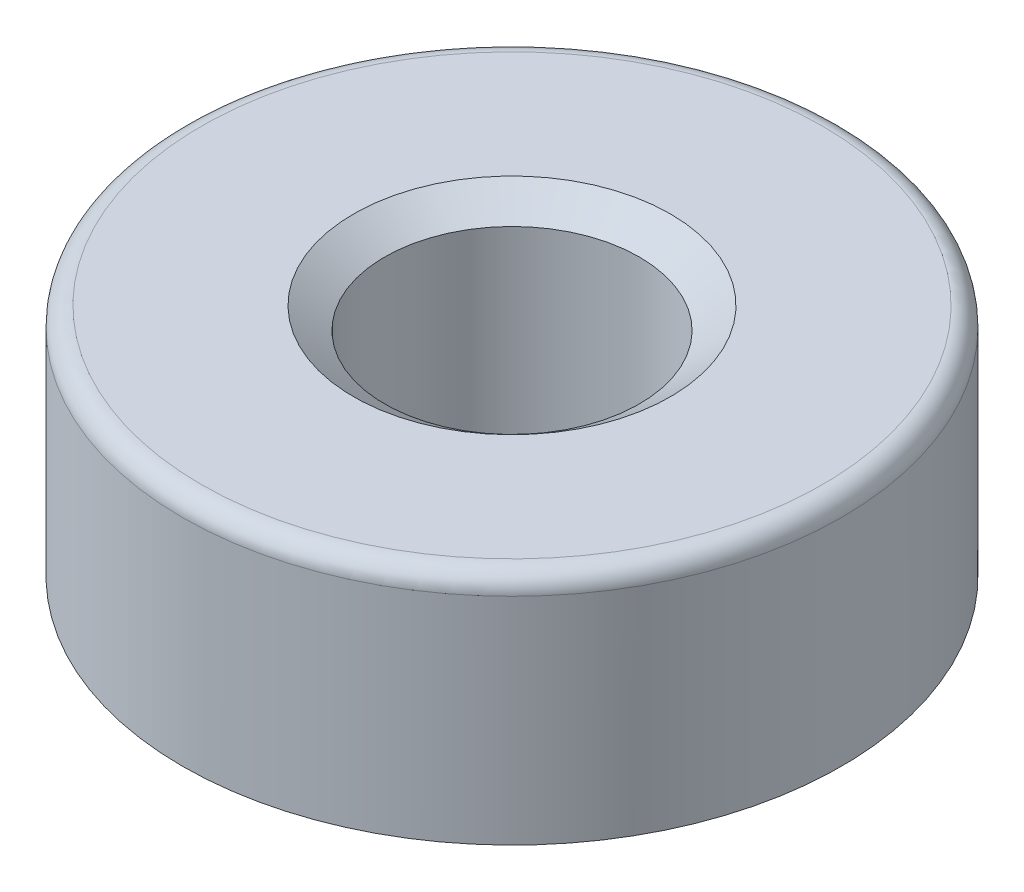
ISO-10303-21;
HEADER;
FILE_DESCRIPTION(('STEP AP214'),'2;1');
FILE_NAME('part.step','',(''),(''),'','','');
FILE_SCHEMA(('AUTOMOTIVE_DESIGN { 1 0 10303 214 1 1 1 1 }'));
ENDSEC;
DATA;
#1=APPLICATION_CONTEXT('core data for automotive mechanical design processes');
#2=APPLICATION_PROTOCOL_DEFINITION('international standard','automotive_design',2000,#1);
#3=PRODUCT_CONTEXT('',#1,'mechanical');
#4=PRODUCT('Part','Part','',(#3));
#5=PRODUCT_RELATED_PRODUCT_CATEGORY('part','',(#4));
#6=PRODUCT_DEFINITION_FORMATION('','',#4);
#7=PRODUCT_DEFINITION_CONTEXT('part definition',#1,'design');
#8=PRODUCT_DEFINITION('design','',#6,#7);
#9=PRODUCT_DEFINITION_SHAPE('','',#8);
#10=(LENGTH_UNIT() NAMED_UNIT(*) SI_UNIT(.MILLI.,.METRE.));
#11=(NAMED_UNIT(*) PLANE_ANGLE_UNIT() SI_UNIT($,.RADIAN.));
#12=(NAMED_UNIT(*) SI_UNIT($,.STERADIAN.) SOLID_ANGLE_UNIT());
#13=UNCERTAINTY_MEASURE_WITH_UNIT(LENGTH_MEASURE(1.E-05),#10,'distance_accuracy_value','');
#14=(GEOMETRIC_REPRESENTATION_CONTEXT(3) GLOBAL_UNCERTAINTY_ASSIGNED_CONTEXT((#13)) GLOBAL_UNIT_ASSIGNED_CONTEXT((#10,
#11,#12)) REPRESENTATION_CONTEXT('',''));
#15=CARTESIAN_POINT('',(0.,0.,0.));
#16=DIRECTION('',(0.,0.,1.));
#17=DIRECTION('',(1.,0.,0.));
#18=AXIS2_PLACEMENT_3D('',#15,#16,#17);
#19=CARTESIAN_POINT('',(0.,-0.6096,0.));
#20=DIRECTION('',(0.,1.,0.));
#21=DIRECTION('',(0.,0.,1.));
#22=AXIS2_PLACEMENT_3D('',#19,#20,#21);
#23=CONICAL_SURFACE('',#22,5.7370345,0.957964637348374);
#24=CARTESIAN_POINT('',(-4.13117819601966,-0.609799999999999,3.9804105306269));
#25=CARTESIAN_POINT('',(-4.20611833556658,-0.50848893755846,4.11021065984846));
#26=CARTESIAN_POINT('',(-4.28099927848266,-0.407003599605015,4.23990825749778));
#27=CARTESIAN_POINT('',(-4.43064275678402,-0.203684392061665,4.49909836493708));
#28=CARTESIAN_POINT('',(-4.50540529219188,-0.10185052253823,4.62859087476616));
#29=CARTESIAN_POINT('',(-4.58010863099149,0.000157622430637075,4.75798085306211));
#30=B_SPLINE_CURVE_WITH_KNOTS('',3,(#24,#25,#26,#27,#28,#29),.UNSPECIFIED.,.F.,.F.,(4,2,4),(0.,
0.542725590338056,1.08545107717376),.UNSPECIFIED.);
#31=CARTESIAN_POINT('',(-4.13132619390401,-0.609599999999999,3.98066687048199));
#32=VERTEX_POINT('',#31);
#33=CARTESIAN_POINT('',(-4.57999316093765,0.,4.75778085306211));
#34=VERTEX_POINT('',#33);
#35=EDGE_CURVE('E285',#32,#34,#30,.T.);
#36=ORIENTED_EDGE('',*,*,#35,.F.);
#37=CARTESIAN_POINT('',(0.,-0.6096,0.));
#38=DIRECTION('',(0.,-1.,0.));
#39=DIRECTION('',(0.,0.,-1.));
#40=AXIS2_PLACEMENT_3D('',#37,#38,#39);
#41=CIRCLE('',#40,5.7370345);
#42=CARTESIAN_POINT('',(-1.38169553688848,-0.6096,5.56816687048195));
#43=VERTEX_POINT('',#42);
#44=EDGE_CURVE('E225',#43,#32,#41,.T.);
#45=ORIENTED_EDGE('',*,*,#44,.F.);
#46=CARTESIAN_POINT('',(-1.83047797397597,0.000157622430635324,6.34548085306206));
#47=CARTESIAN_POINT('',(-1.75577463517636,-0.101850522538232,6.21609087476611));
#48=CARTESIAN_POINT('',(-1.6810120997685,-0.203684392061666,6.08659836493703));
#49=CARTESIAN_POINT('',(-1.53136862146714,-0.407003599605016,5.82740825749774));
#50=CARTESIAN_POINT('',(-1.45648767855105,-0.50848893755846,5.69771065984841));
#51=CARTESIAN_POINT('',(-1.38154753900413,-0.6098,5.56791053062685));
#52=B_SPLINE_CURVE_WITH_KNOTS('',3,(#46,#47,#48,#49,#50,#51),.UNSPECIFIED.,.F.,.F.,(4,2,4),(0.,
0.542725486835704,1.08545107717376),.UNSPECIFIED.);
#53=CARTESIAN_POINT('',(-1.83036250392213,0.,6.34528085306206));
#54=VERTEX_POINT('',#53);
#55=EDGE_CURVE('E193',#54,#43,#52,.T.);
#56=ORIENTED_EDGE('',*,*,#55,.F.);
#57=CARTESIAN_POINT('',(0.,0.,0.));
#58=DIRECTION('',(0.,-1.,0.));
#59=DIRECTION('',(0.,0.,-1.));
#60=AXIS2_PLACEMENT_3D('',#57,#58,#59);
#61=CIRCLE('',#60,6.604);
#62=EDGE_CURVE('E148',#54,#34,#61,.T.);
#63=ORIENTED_EDGE('',*,*,#62,.T.);
#64=EDGE_LOOP('',(#36,#45,#56,#63));
#65=FACE_BOUND('',#64,.T.);
#66=ADVANCED_FACE('F41',(#65),#23,.T.);
#67=CARTESIAN_POINT('',(0.,0.,0.));
#68=DIRECTION('',(0.,-1.,0.));
#69=DIRECTION('',(0.,0.,-1.));
#70=AXIS2_PLACEMENT_3D('',#67,#68,#69);
#71=CONICAL_SURFACE('',#70,4.8674655,0.959374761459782);
#72=CARTESIAN_POINT('',(-3.67535542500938,0.000153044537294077,3.19090233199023));
#73=CARTESIAN_POINT('',(-3.71346949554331,-0.0503643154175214,3.25691783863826));
#74=CARTESIAN_POINT('',(-3.75155322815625,-0.100973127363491,3.32288079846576));
#75=CARTESIAN_POINT('',(-3.8276665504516,-0.202352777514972,3.45471293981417));
#76=CARTESIAN_POINT('',(-3.8656961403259,-0.253123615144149,3.52058212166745));
#77=CARTESIAN_POINT('',(-3.94170795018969,-0.354806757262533,3.65223843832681));
#78=CARTESIAN_POINT('',(-3.97969017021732,-0.405719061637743,3.71802557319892));
#79=CARTESIAN_POINT('',(-4.05561262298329,-0.507669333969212,3.84952711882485));
#80=CARTESIAN_POINT('',(-4.09355285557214,-0.55870730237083,3.91524152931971));
#81=CARTESIAN_POINT('',(-4.13147463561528,-0.609800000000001,3.98092397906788));
#82=B_SPLINE_CURVE_WITH_KNOTS('',3,(#72,#73,#74,#75,#76,#77,#78,#79,#80,#81),.UNSPECIFIED.,.F.,
.F.,(4,2,2,2,4),(0.,0.274343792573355,0.548686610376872,0.823029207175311,1.09737277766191),.UNSPECIFIED.);
#83=CARTESIAN_POINT('',(-3.67547089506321,0.,3.19110233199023));
#84=VERTEX_POINT('',#83);
#85=EDGE_CURVE('E145',#84,#32,#82,.T.);
#86=ORIENTED_EDGE('',*,*,#85,.F.);
#87=CARTESIAN_POINT('',(0.,0.,0.));
#88=DIRECTION('',(0.,-1.,0.));
#89=DIRECTION('',(0.,0.,-1.));
#90=AXIS2_PLACEMENT_3D('',#87,#88,#89);
#91=CIRCLE('',#90,4.8674655);
#92=CARTESIAN_POINT('',(-0.925840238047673,0.,4.77860233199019));
#93=VERTEX_POINT('',#92);
#94=EDGE_CURVE('E227',#93,#84,#91,.T.);
#95=ORIENTED_EDGE('',*,*,#94,.F.);
#96=CARTESIAN_POINT('',(-1.38184397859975,-0.6098,5.56842397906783));
#97=CARTESIAN_POINT('',(-1.34392219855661,-0.558707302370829,5.50274152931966));
#98=CARTESIAN_POINT('',(-1.30598196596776,-0.507669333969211,5.4370271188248));
#99=CARTESIAN_POINT('',(-1.23005951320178,-0.405719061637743,5.30552557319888));
#100=CARTESIAN_POINT('',(-1.19207729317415,-0.354806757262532,5.23973843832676));
#101=CARTESIAN_POINT('',(-1.11606548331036,-0.253123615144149,5.10808212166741));
#102=CARTESIAN_POINT('',(-1.07803589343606,-0.202352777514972,5.04221293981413));
#103=CARTESIAN_POINT('',(-1.00192257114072,-0.100973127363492,4.91038079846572));
#104=CARTESIAN_POINT('',(-0.963838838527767,-0.0503643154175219,4.84441783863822));
#105=CARTESIAN_POINT('',(-0.925724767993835,0.000153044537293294,4.77840233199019));
#106=B_SPLINE_CURVE_WITH_KNOTS('',3,(#96,#97,#98,#99,#100,#101,#102,#103,#104,#105),
.UNSPECIFIED.,.F.,.F.,(4,2,2,2,4),(0.,0.274343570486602,0.54868616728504,0.823028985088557,
1.09737277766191),.UNSPECIFIED.);
#107=EDGE_CURVE('E157',#43,#93,#106,.T.);
#108=ORIENTED_EDGE('',*,*,#107,.F.);
#109=ORIENTED_EDGE('',*,*,#44,.T.);
#110=EDGE_LOOP('',(#86,#95,#108,#109));
#111=FACE_BOUND('',#110,.T.);
#112=ADVANCED_FACE('F256',(#111),#71,.F.);
#113=CARTESIAN_POINT('',(-4.58010863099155,0.000157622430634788,-4.75798085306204));
#114=CARTESIAN_POINT('',(-4.50540529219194,-0.101850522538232,-4.6285908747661));
#115=CARTESIAN_POINT('',(-4.43064275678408,-0.203684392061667,-4.49909836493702));
#116=CARTESIAN_POINT('',(-4.28099927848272,-0.407003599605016,-4.23990825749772));
#117=CARTESIAN_POINT('',(-4.20611833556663,-0.50848893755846,-4.1102106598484));
#118=CARTESIAN_POINT('',(-4.13117819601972,-0.609799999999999,-3.98041053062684));
#119=B_SPLINE_CURVE_WITH_KNOTS('',3,(#113,#114,#115,#116,#117,#118),.UNSPECIFIED.,.F.,.F.,(4,2,
4),(0.,0.542725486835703,1.08545107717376),.UNSPECIFIED.);
#120=CARTESIAN_POINT('',(-4.57999316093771,0.,-4.75778085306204));
#121=VERTEX_POINT('',#120);
#122=CARTESIAN_POINT('',(-4.13132619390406,-0.6096,-3.98066687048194));
#123=VERTEX_POINT('',#122);
#124=EDGE_CURVE('E130',#121,#123,#119,.T.);
#125=ORIENTED_EDGE('',*,*,#124,.F.);
#126=CARTESIAN_POINT('',(-1.83036250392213,0.,-6.34528085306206));
#127=VERTEX_POINT('',#126);
#128=EDGE_CURVE('E136',#121,#127,#61,.T.);
#129=ORIENTED_EDGE('',*,*,#128,.T.);
#130=CARTESIAN_POINT('',(-1.38154753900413,-0.6098,-5.56791053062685));
#131=CARTESIAN_POINT('',(-1.45648767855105,-0.50848893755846,-5.69771065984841));
#132=CARTESIAN_POINT('',(-1.53136862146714,-0.407003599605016,-5.82740825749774));
#133=CARTESIAN_POINT('',(-1.6810120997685,-0.203684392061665,-6.08659836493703));
#134=CARTESIAN_POINT('',(-1.75577463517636,-0.101850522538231,-6.21609087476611));
#135=CARTESIAN_POINT('',(-1.83047797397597,0.000157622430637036,-6.34548085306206));
#136=B_SPLINE_CURVE_WITH_KNOTS('',3,(#130,#131,#132,#133,#134,#135),.UNSPECIFIED.,.F.,.F.,(4,2,
4),(0.,0.542725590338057,1.08545107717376),.UNSPECIFIED.);
#137=CARTESIAN_POINT('',(-1.38169553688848,-0.6096,-5.56816687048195));
#138=VERTEX_POINT('',#137);
#139=EDGE_CURVE('E277',#138,#127,#136,.T.);
#140=ORIENTED_EDGE('',*,*,#139,.F.);
#141=EDGE_CURVE('E142',#123,#138,#41,.T.);
#142=ORIENTED_EDGE('',*,*,#141,.F.);
#143=EDGE_LOOP('',(#125,#129,#140,#142));
#144=FACE_BOUND('',#143,.T.);
#145=ADVANCED_FACE('F140',(#144),#23,.T.);
#146=CARTESIAN_POINT('',(-4.13147463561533,-0.6098,-3.98092397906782));
#147=CARTESIAN_POINT('',(-4.09355285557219,-0.558707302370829,-3.91524152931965));
#148=CARTESIAN_POINT('',(-4.05561262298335,-0.507669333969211,-3.84952711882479));
#149=CARTESIAN_POINT('',(-3.97969017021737,-0.405719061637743,-3.71802557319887));
#150=CARTESIAN_POINT('',(-3.94170795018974,-0.354806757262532,-3.65223843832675));
#151=CARTESIAN_POINT('',(-3.86569614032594,-0.253123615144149,-3.5205821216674));
#152=CARTESIAN_POINT('',(-3.82766655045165,-0.202352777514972,-3.45471293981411));
#153=CARTESIAN_POINT('',(-3.7515532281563,-0.100973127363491,-3.3228807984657));
#154=CARTESIAN_POINT('',(-3.71346949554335,-0.0503643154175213,-3.25691783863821));
#155=CARTESIAN_POINT('',(-3.67535542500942,0.000153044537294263,-3.19090233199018));
#156=B_SPLINE_CURVE_WITH_KNOTS('',3,(#146,#147,#148,#149,#150,#151,#152,#153,#154,#155),
.UNSPECIFIED.,.F.,.F.,(4,2,2,2,4),(0.,0.274343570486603,0.548686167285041,0.823028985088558,
1.09737277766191),.UNSPECIFIED.);
#157=CARTESIAN_POINT('',(-3.67547089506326,0.,-3.19110233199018));
#158=VERTEX_POINT('',#157);
#159=EDGE_CURVE('E135',#123,#158,#156,.T.);
#160=ORIENTED_EDGE('',*,*,#159,.F.);
#161=ORIENTED_EDGE('',*,*,#141,.T.);
#162=CARTESIAN_POINT('',(-0.925724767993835,0.000153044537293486,-4.77840233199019));
#163=CARTESIAN_POINT('',(-0.963838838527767,-0.0503643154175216,-4.84441783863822));
#164=CARTESIAN_POINT('',(-1.00192257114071,-0.100973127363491,-4.91038079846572));
#165=CARTESIAN_POINT('',(-1.07803589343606,-0.202352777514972,-5.04221293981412));
#166=CARTESIAN_POINT('',(-1.11606548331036,-0.253123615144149,-5.10808212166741));
#167=CARTESIAN_POINT('',(-1.19207729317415,-0.354806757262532,-5.23973843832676));
#168=CARTESIAN_POINT('',(-1.23005951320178,-0.405719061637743,-5.30552557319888));
#169=CARTESIAN_POINT('',(-1.30598196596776,-0.507669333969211,-5.4370271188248));
#170=CARTESIAN_POINT('',(-1.34392219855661,-0.558707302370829,-5.50274152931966));
#171=CARTESIAN_POINT('',(-1.38184397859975,-0.6098,-5.56842397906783));
#172=B_SPLINE_CURVE_WITH_KNOTS('',3,(#162,#163,#164,#165,#166,#167,#168,#169,#170,#171),
.UNSPECIFIED.,.F.,.F.,(4,2,2,2,4),(0.,0.274343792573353,0.54868661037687,0.823029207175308,
1.09737277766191),.UNSPECIFIED.);
#173=CARTESIAN_POINT('',(-0.925840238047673,0.,-4.77860233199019));
#174=VERTEX_POINT('',#173);
#175=EDGE_CURVE('E12',#174,#138,#172,.T.);
#176=ORIENTED_EDGE('',*,*,#175,.F.);
#177=EDGE_CURVE('E229',#158,#174,#91,.T.);
#178=ORIENTED_EDGE('',*,*,#177,.F.);
#179=EDGE_LOOP('',(#160,#161,#176,#178));
#180=FACE_BOUND('',#179,.T.);
#181=ADVANCED_FACE('F265',(#180),#71,.F.);
#182=CARTESIAN_POINT('',(8.88359413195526,1.70183097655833,-1.5875));
#183=CARTESIAN_POINT('',(8.62766235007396,1.52469212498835,-1.5875));
#184=CARTESIAN_POINT('',(8.37162948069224,1.34769885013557,-1.5875));
#185=CARTESIAN_POINT('',(7.85927634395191,0.994136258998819,-1.5875));
#186=CARTESIAN_POINT('',(7.60295608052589,0.817566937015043,-1.5875));
#187=CARTESIAN_POINT('',(7.08997105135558,0.465004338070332,-1.5875));
#188=CARTESIAN_POINT('',(6.83330633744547,0.289010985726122,-1.5875));
#189=CARTESIAN_POINT('',(6.31945101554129,-0.0622159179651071,-1.5875));
#190=CARTESIAN_POINT('',(6.0622603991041,-0.237449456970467,-1.5875));
#191=CARTESIAN_POINT('',(5.54708808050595,-0.586858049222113,-1.5875));
#192=CARTESIAN_POINT('',(5.2891062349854,-0.761032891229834,-1.5875));
#193=CARTESIAN_POINT('',(4.77205723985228,-1.10774785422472,-1.5875));
#194=CARTESIAN_POINT('',(4.51299013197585,-1.2802880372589,-1.5875));
#195=CARTESIAN_POINT('',(4.12306667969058,-1.53714244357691,-1.5875));
#196=CARTESIAN_POINT('',(3.9928600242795,-1.62244214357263,-1.5875));
#197=CARTESIAN_POINT('',(3.73188216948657,-1.79216931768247,-1.5875));
#198=CARTESIAN_POINT('',(3.60111097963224,-1.87659680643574,-1.5875));
#199=CARTESIAN_POINT('',(3.33881666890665,-2.04431754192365,-1.5875));
#200=CARTESIAN_POINT('',(3.20729345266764,-2.12761064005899,-1.5875));
#201=CARTESIAN_POINT('',(2.94322406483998,-2.29257431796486,-1.5875));
#202=CARTESIAN_POINT('',(2.81067783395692,-2.37424480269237,-1.5875));
#203=CARTESIAN_POINT('',(2.67748382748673,-2.45486052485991,-1.5875));
#204=B_SPLINE_CURVE_WITH_KNOTS('',3,(#182,#183,#184,#185,#186,#187,#188,#189,#190,#191,#192,
#193,#194,#195,#196,#197,#198,#199,#200,#201,#202,#203),.UNSPECIFIED.,.F.,.F.,(4,2,2,2,2,2,2,2,
2,2,4),(0.,0.933763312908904,1.86751400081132,2.80113715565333,3.73477541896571,
4.66859422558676,5.60237744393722,6.06935260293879,6.53631991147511,7.00334781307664,
7.47040299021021),.UNSPECIFIED.);
#205=CARTESIAN_POINT('',(6.41035566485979,0.,-1.5875));
#206=VERTEX_POINT('',#205);
#207=CARTESIAN_POINT('',(5.51302173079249,-0.6096,-1.5875));
#208=VERTEX_POINT('',#207);
#209=EDGE_CURVE('E271',#206,#208,#204,.T.);
#210=ORIENTED_EDGE('',*,*,#209,.F.);
#211=CARTESIAN_POINT('',(6.41035566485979,0.,1.5875));
#212=VERTEX_POINT('',#211);
#213=EDGE_CURVE('E150',#206,#212,#61,.T.);
#214=ORIENTED_EDGE('',*,*,#213,.T.);
#215=CARTESIAN_POINT('',(2.67748382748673,-2.45486052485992,1.5875));
#216=CARTESIAN_POINT('',(2.81067783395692,-2.37424480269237,1.5875));
#217=CARTESIAN_POINT('',(2.94322406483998,-2.29257431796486,1.5875));
#218=CARTESIAN_POINT('',(3.20729345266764,-2.12761064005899,1.5875));
#219=CARTESIAN_POINT('',(3.33881666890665,-2.04431754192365,1.5875));
#220=CARTESIAN_POINT('',(3.60111097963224,-1.87659680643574,1.5875));
#221=CARTESIAN_POINT('',(3.73188216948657,-1.79216931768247,1.5875));
#222=CARTESIAN_POINT('',(3.9928600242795,-1.62244214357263,1.5875));
#223=CARTESIAN_POINT('',(4.12306667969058,-1.53714244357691,1.5875));
#224=CARTESIAN_POINT('',(4.51299013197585,-1.2802880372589,1.5875));
#225=CARTESIAN_POINT('',(4.77205723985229,-1.10774785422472,1.5875));
#226=CARTESIAN_POINT('',(5.28910623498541,-0.761032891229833,1.5875));
#227=CARTESIAN_POINT('',(5.54708808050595,-0.586858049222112,1.5875));
#228=CARTESIAN_POINT('',(6.0622603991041,-0.237449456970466,1.5875));
#229=CARTESIAN_POINT('',(6.31945101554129,-0.0622159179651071,1.5875));
#230=CARTESIAN_POINT('',(6.83330633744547,0.289010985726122,1.5875));
#231=CARTESIAN_POINT('',(7.08997105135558,0.465004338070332,1.5875));
#232=CARTESIAN_POINT('',(7.60295608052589,0.817566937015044,1.5875));
#233=CARTESIAN_POINT('',(7.85927634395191,0.99413625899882,1.5875));
#234=CARTESIAN_POINT('',(8.37162948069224,1.34769885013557,1.5875));
#235=CARTESIAN_POINT('',(8.62766235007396,1.52469212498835,1.5875));
#236=CARTESIAN_POINT('',(8.88359413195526,1.70183097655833,1.5875));
#237=B_SPLINE_CURVE_WITH_KNOTS('',3,(#215,#216,#217,#218,#219,#220,#221,#222,#223,#224,#225,
#226,#227,#228,#229,#230,#231,#232,#233,#234,#235,#236),.UNSPECIFIED.,.F.,.F.,(4,2,2,2,2,2,2,2,
2,2,4),(0.,0.467055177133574,0.934083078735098,1.40105038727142,1.868025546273,2.80180876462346,
3.73562757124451,4.66926583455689,5.60288898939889,6.53663967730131,7.47040299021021),.UNSPECIFIED.);
#238=CARTESIAN_POINT('',(5.51302173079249,-0.6096,1.5875));
#239=VERTEX_POINT('',#238);
#240=EDGE_CURVE('E202',#239,#212,#237,.T.);
#241=ORIENTED_EDGE('',*,*,#240,.F.);
#242=EDGE_CURVE('E228',#208,#239,#41,.T.);
#243=ORIENTED_EDGE('',*,*,#242,.F.);
#244=EDGE_LOOP('',(#210,#214,#241,#243));
#245=FACE_BOUND('',#244,.T.);
#246=ADVANCED_FACE('F43',(#245),#23,.T.);
#247=CARTESIAN_POINT('',(0.,0.,0.));
#248=DIRECTION('',(0.,-1.,0.));
#249=DIRECTION('',(0.,0.,-1.));
#250=AXIS2_PLACEMENT_3D('',#247,#248,#249);
#251=CYLINDRICAL_SURFACE('',#250,6.604);
#252=CARTESIAN_POINT('',(0.,4.318,0.));
#253=DIRECTION('',(0.,-1.,0.));
#254=DIRECTION('',(0.,0.,-1.));
#255=AXIS2_PLACEMENT_3D('',#252,#253,#254);
#256=CIRCLE('',#255,6.604);
#257=CARTESIAN_POINT('',(0.,4.318,-6.604));
#258=VERTEX_POINT('',#257);
#259=EDGE_CURVE('E152',#258,#258,#256,.T.);
#260=ORIENTED_EDGE('',*,*,#259,.T.);
#261=EDGE_LOOP('',(#260));
#262=FACE_BOUND('',#261,.T.);
#263=EDGE_CURVE('E155',#212,#54,#61,.T.);
#264=ORIENTED_EDGE('',*,*,#263,.F.);
#265=ORIENTED_EDGE('',*,*,#213,.F.);
#266=CARTESIAN_POINT('',(0.,0.,0.));
#267=DIRECTION('',(0.,1.,0.));
#268=DIRECTION('',(0.866025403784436,0.,-0.500000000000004));
#269=AXIS2_PLACEMENT_3D('',#266,#267,#268);
#270=CIRCLE('',#269,6.604);
#271=EDGE_CURVE('E149',#206,#127,#270,.T.);
#272=ORIENTED_EDGE('',*,*,#271,.T.);
#273=ORIENTED_EDGE('',*,*,#128,.F.);
#274=CARTESIAN_POINT('',(0.,0.,0.));
#275=DIRECTION('',(0.,1.,0.));
#276=DIRECTION('',(-0.866025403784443,0.,-0.499999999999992));
#277=AXIS2_PLACEMENT_3D('',#274,#275,#276);
#278=CIRCLE('',#277,6.604);
#279=EDGE_CURVE('E120',#121,#34,#278,.T.);
#280=ORIENTED_EDGE('',*,*,#279,.T.);
#281=ORIENTED_EDGE('',*,*,#62,.F.);
#282=EDGE_LOOP('',(#264,#265,#272,#273,#280,#281));
#283=FACE_BOUND('',#282,.T.);
#284=ADVANCED_FACE('F146',(#262,#283),#251,.T.);
#285=CARTESIAN_POINT('',(0.,4.318,0.));
#286=DIRECTION('',(0.,-1.,0.));
#287=DIRECTION('',(0.,0.,-1.));
#288=AXIS2_PLACEMENT_3D('',#285,#286,#287);
#289=TOROIDAL_SURFACE('',#288,6.223,0.381);
#290=CARTESIAN_POINT('',(0.,4.699,0.));
#291=DIRECTION('',(0.,-1.,0.));
#292=DIRECTION('',(0.,0.,-1.));
#293=AXIS2_PLACEMENT_3D('',#290,#291,#292);
#294=CIRCLE('',#293,6.223);
#295=CARTESIAN_POINT('',(0.,4.699,-6.223));
#296=VERTEX_POINT('',#295);
#297=EDGE_CURVE('E236',#296,#296,#294,.T.);
#298=ORIENTED_EDGE('',*,*,#297,.T.);
#299=EDGE_LOOP('',(#298));
#300=FACE_BOUND('',#299,.T.);
#301=ORIENTED_EDGE('',*,*,#259,.F.);
#302=EDGE_LOOP('',(#301));
#303=FACE_BOUND('',#302,.T.);
#304=ADVANCED_FACE('F245',(#300,#303),#289,.T.);
#305=CARTESIAN_POINT('',(6.223,4.699,0.));
#306=DIRECTION('',(0.,1.,0.));
#307=DIRECTION('',(0.,0.,1.));
#308=AXIS2_PLACEMENT_3D('',#305,#306,#307);
#309=PLANE('',#308);
#310=CARTESIAN_POINT('',(0.,4.699,0.));
#311=DIRECTION('',(0.,-1.,0.));
#312=DIRECTION('',(0.,0.,-1.));
#313=AXIS2_PLACEMENT_3D('',#310,#311,#312);
#314=CIRCLE('',#313,3.175);
#315=CARTESIAN_POINT('',(0.,4.699,-3.175));
#316=VERTEX_POINT('',#315);
#317=EDGE_CURVE('E214',#316,#316,#314,.T.);
#318=ORIENTED_EDGE('',*,*,#317,.T.);
#319=EDGE_LOOP('',(#318));
#320=FACE_BOUND('',#319,.T.);
#321=ORIENTED_EDGE('',*,*,#297,.F.);
#322=EDGE_LOOP('',(#321));
#323=FACE_BOUND('',#322,.T.);
#324=ADVANCED_FACE('F242',(#320,#323),#309,.T.);
#325=CARTESIAN_POINT('',(0.,0.,0.));
#326=DIRECTION('',(0.,-1.,0.));
#327=DIRECTION('',(0.,0.,-1.));
#328=AXIS2_PLACEMENT_3D('',#325,#326,#327);
#329=CYLINDRICAL_SURFACE('',#328,2.5527);
#330=CARTESIAN_POINT('',(0.,4.26342269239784,0.));
#331=DIRECTION('',(0.,-1.,0.));
#332=DIRECTION('',(0.,0.,-1.));
#333=AXIS2_PLACEMENT_3D('',#330,#331,#332);
#334=CIRCLE('',#333,2.5527);
#335=CARTESIAN_POINT('',(0.,4.26342269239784,-2.5527));
#336=VERTEX_POINT('',#335);
#337=EDGE_CURVE('E208',#336,#336,#334,.T.);
#338=ORIENTED_EDGE('',*,*,#337,.F.);
#339=EDGE_LOOP('',(#338));
#340=FACE_BOUND('',#339,.T.);
#341=CARTESIAN_POINT('',(0.,-0.52962269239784,0.));
#342=DIRECTION('',(0.,-1.,0.));
#343=DIRECTION('',(0.,0.,-1.));
#344=AXIS2_PLACEMENT_3D('',#341,#342,#343);
#345=CIRCLE('',#344,2.5527);
#346=CARTESIAN_POINT('',(0.,-0.52962269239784,-2.5527));
#347=VERTEX_POINT('',#346);
#348=EDGE_CURVE('E216',#347,#347,#345,.T.);
#349=ORIENTED_EDGE('',*,*,#348,.T.);
#350=EDGE_LOOP('',(#349));
#351=FACE_BOUND('',#350,.T.);
#352=ADVANCED_FACE('F252',(#340,#351),#329,.F.);
#353=CARTESIAN_POINT('',(2.5527,-1.2192,0.));
#354=DIRECTION('',(0.,-1.,0.));
#355=DIRECTION('',(0.,0.,-1.));
#356=AXIS2_PLACEMENT_3D('',#353,#354,#355);
#357=PLANE('',#356);
#358=CARTESIAN_POINT('',(0.,-1.2192,0.));
#359=DIRECTION('',(0.,-1.,0.));
#360=DIRECTION('',(0.,0.,-1.));
#361=AXIS2_PLACEMENT_3D('',#358,#359,#360);
#362=CIRCLE('',#361,3.175);
#363=CARTESIAN_POINT('',(0.,-1.2192,-3.175));
#364=VERTEX_POINT('',#363);
#365=EDGE_CURVE('E175',#364,#364,#362,.T.);
#366=ORIENTED_EDGE('',*,*,#365,.F.);
#367=EDGE_LOOP('',(#366));
#368=FACE_BOUND('',#367,.T.);
#369=CARTESIAN_POINT('',(0.,-1.2192,0.));
#370=DIRECTION('',(0.,-1.,0.));
#371=DIRECTION('',(0.,0.,-1.));
#372=AXIS2_PLACEMENT_3D('',#369,#370,#371);
#373=CIRCLE('',#372,4.0005);
#374=CARTESIAN_POINT('',(0.,-1.2192,-4.0005));
#375=VERTEX_POINT('',#374);
#376=EDGE_CURVE('E231',#375,#375,#373,.T.);
#377=ORIENTED_EDGE('',*,*,#376,.T.);
#378=EDGE_LOOP('',(#377));
#379=FACE_BOUND('',#378,.T.);
#380=ADVANCED_FACE('F323',(#368,#379),#357,.T.);
#381=CARTESIAN_POINT('',(0.,0.,0.));
#382=DIRECTION('',(0.,-1.,0.));
#383=DIRECTION('',(0.,0.,-1.));
#384=AXIS2_PLACEMENT_3D('',#381,#382,#383);
#385=CYLINDRICAL_SURFACE('',#384,4.0005);
#386=CARTESIAN_POINT('',(0.,0.,0.));
#387=DIRECTION('',(0.,-1.,0.));
#388=DIRECTION('',(0.,0.,-1.));
#389=AXIS2_PLACEMENT_3D('',#386,#387,#388);
#390=CIRCLE('',#389,4.0005);
#391=CARTESIAN_POINT('',(0.,0.,-4.0005));
#392=VERTEX_POINT('',#391);
#393=EDGE_CURVE('E230',#392,#392,#390,.T.);
#394=ORIENTED_EDGE('',*,*,#393,.T.);
#395=EDGE_LOOP('',(#394));
#396=FACE_BOUND('',#395,.T.);
#397=ORIENTED_EDGE('',*,*,#376,.F.);
#398=EDGE_LOOP('',(#397));
#399=FACE_BOUND('',#398,.T.);
#400=ADVANCED_FACE('F330',(#396,#399),#385,.T.);
#401=CARTESIAN_POINT('',(4.0005,0.,0.));
#402=DIRECTION('',(0.,-1.,0.));
#403=DIRECTION('',(0.,0.,-1.));
#404=AXIS2_PLACEMENT_3D('',#401,#402,#403);
#405=PLANE('',#404);
#406=ORIENTED_EDGE('',*,*,#94,.T.);
#407=DIRECTION('',(0.499999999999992,0.,-0.866025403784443));
#408=VECTOR('',#407,1.);
#409=CARTESIAN_POINT('',(-3.67547089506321,0.,3.19110233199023));
#410=LINE('',#409,#408);
#411=EDGE_CURVE('E122',#34,#84,#410,.T.);
#412=ORIENTED_EDGE('',*,*,#411,.F.);
#413=ORIENTED_EDGE('',*,*,#279,.F.);
#414=DIRECTION('',(-0.500000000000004,0.,-0.866025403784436));
#415=VECTOR('',#414,1.);
#416=CARTESIAN_POINT('',(-3.67547089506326,0.,-3.19110233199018));
#417=LINE('',#416,#415);
#418=EDGE_CURVE('E64',#158,#121,#417,.T.);
#419=ORIENTED_EDGE('',*,*,#418,.F.);
#420=ORIENTED_EDGE('',*,*,#177,.T.);
#421=DIRECTION('',(0.500000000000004,0.,0.866025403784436));
#422=VECTOR('',#421,1.);
#423=CARTESIAN_POINT('',(-0.925840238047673,0.,-4.77860233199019));
#424=LINE('',#423,#422);
#425=EDGE_CURVE('E279',#127,#174,#424,.T.);
#426=ORIENTED_EDGE('',*,*,#425,.F.);
#427=ORIENTED_EDGE('',*,*,#271,.F.);
#428=DIRECTION('',(1.,0.,0.));
#429=VECTOR('',#428,1.);
#430=CARTESIAN_POINT('',(4.60131113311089,0.,-1.5875));
#431=LINE('',#430,#429);
#432=CARTESIAN_POINT('',(4.60131113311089,0.,-1.5875));
#433=VERTEX_POINT('',#432);
#434=EDGE_CURVE('E69',#433,#206,#431,.T.);
#435=ORIENTED_EDGE('',*,*,#434,.F.);
#436=CARTESIAN_POINT('',(4.60131113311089,0.,1.5875));
#437=VERTEX_POINT('',#436);
#438=EDGE_CURVE('E223',#433,#437,#91,.T.);
#439=ORIENTED_EDGE('',*,*,#438,.T.);
#440=DIRECTION('',(-1.,0.,0.));
#441=VECTOR('',#440,1.);
#442=CARTESIAN_POINT('',(4.60131113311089,0.,1.5875));
#443=LINE('',#442,#441);
#444=EDGE_CURVE('E205',#212,#437,#443,.T.);
#445=ORIENTED_EDGE('',*,*,#444,.F.);
#446=ORIENTED_EDGE('',*,*,#263,.T.);
#447=DIRECTION('',(-0.500000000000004,0.,0.866025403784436));
#448=VECTOR('',#447,1.);
#449=CARTESIAN_POINT('',(-0.925840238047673,0.,4.77860233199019));
#450=LINE('',#449,#448);
#451=EDGE_CURVE('E282',#93,#54,#450,.T.);
#452=ORIENTED_EDGE('',*,*,#451,.F.);
#453=EDGE_LOOP('',(#406,#412,#413,#419,#420,#426,#427,#435,#439,#445,#446,#452));
#454=FACE_BOUND('',#453,.T.);
#455=ORIENTED_EDGE('',*,*,#393,.F.);
#456=EDGE_LOOP('',(#455));
#457=FACE_BOUND('',#456,.T.);
#458=ADVANCED_FACE('F118',(#454,#457),#405,.T.);
#459=CARTESIAN_POINT('',(7.21485407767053,-1.7665955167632,-1.5875));
#460=CARTESIAN_POINT('',(7.03974524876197,-1.64671176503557,-1.5875));
#461=CARTESIAN_POINT('',(6.86454774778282,-1.5269571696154,-1.5875));
#462=CARTESIAN_POINT('',(6.51391694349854,-1.28779133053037,-1.5875));
#463=CARTESIAN_POINT('',(6.33848363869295,-1.16838008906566,-1.5875));
#464=CARTESIAN_POINT('',(5.98734282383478,-0.92999962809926,-1.5875));
#465=CARTESIAN_POINT('',(5.81163534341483,-0.811030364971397,-1.5875));
#466=CARTESIAN_POINT('',(5.45984461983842,-0.573649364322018,-1.5875));
#467=CARTESIAN_POINT('',(5.28376137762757,-0.455237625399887,-1.5875));
#468=CARTESIAN_POINT('',(4.9310810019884,-0.21913688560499,-1.5875));
#469=CARTESIAN_POINT('',(4.75448381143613,-0.101447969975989,-1.5875));
#470=CARTESIAN_POINT('',(4.4006274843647,0.132924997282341,-1.5875));
#471=CARTESIAN_POINT('',(4.22336835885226,0.24960906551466,-1.5875));
#472=CARTESIAN_POINT('',(3.86791031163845,0.481582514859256,-1.5875));
#473=CARTESIAN_POINT('',(3.68971129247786,0.596871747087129,-1.5875));
#474=CARTESIAN_POINT('',(3.42141228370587,0.76825142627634,-1.5875));
#475=CARTESIAN_POINT('',(3.33181003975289,0.825120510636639,-1.5875));
#476=CARTESIAN_POINT('',(3.15219233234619,0.938205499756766,-1.5875));
#477=CARTESIAN_POINT('',(3.06217686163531,0.994421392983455,-1.5875));
#478=CARTESIAN_POINT('',(2.97191568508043,1.05024267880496,-1.5875));
#479=B_SPLINE_CURVE_WITH_KNOTS('',3,(#459,#460,#461,#462,#463,#464,#465,#466,#467,#468,#469,
#470,#471,#472,#473,#474,#475,#476,#477,#478),.UNSPECIFIED.,.F.,.F.,(4,2,2,2,2,2,2,2,2,4),(0.,
0.636645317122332,1.27329470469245,1.90987948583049,2.54646266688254,3.18311953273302,
3.81976585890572,4.45647955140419,4.77485402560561,5.0932341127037),.UNSPECIFIED.);
#480=EDGE_CURVE('E57',#208,#433,#479,.T.);
#481=ORIENTED_EDGE('',*,*,#480,.F.);
#482=ORIENTED_EDGE('',*,*,#242,.T.);
#483=CARTESIAN_POINT('',(2.97191568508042,1.05024267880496,1.5875));
#484=CARTESIAN_POINT('',(3.06217686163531,0.994421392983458,1.5875));
#485=CARTESIAN_POINT('',(3.15219233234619,0.938205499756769,1.5875));
#486=CARTESIAN_POINT('',(3.33181003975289,0.825120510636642,1.5875));
#487=CARTESIAN_POINT('',(3.42141228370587,0.768251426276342,1.5875));
#488=CARTESIAN_POINT('',(3.68971129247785,0.596871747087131,1.5875));
#489=CARTESIAN_POINT('',(3.86791031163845,0.48158251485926,1.5875));
#490=CARTESIAN_POINT('',(4.22336835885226,0.249609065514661,1.5875));
#491=CARTESIAN_POINT('',(4.40062748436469,0.132924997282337,1.5875));
#492=CARTESIAN_POINT('',(4.75448381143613,-0.101447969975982,1.5875));
#493=CARTESIAN_POINT('',(4.93108100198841,-0.219136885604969,1.5875));
#494=CARTESIAN_POINT('',(5.28376137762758,-0.455237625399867,1.5875));
#495=CARTESIAN_POINT('',(5.45984461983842,-0.573649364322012,1.5875));
#496=CARTESIAN_POINT('',(5.81163534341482,-0.811030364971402,1.5875));
#497=CARTESIAN_POINT('',(5.98734282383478,-0.929999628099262,1.5875));
#498=CARTESIAN_POINT('',(6.33848363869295,-1.16838008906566,1.5875));
#499=CARTESIAN_POINT('',(6.51391694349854,-1.28779133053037,1.5875));
#500=CARTESIAN_POINT('',(6.86454774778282,-1.5269571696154,1.5875));
#501=CARTESIAN_POINT('',(7.03974524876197,-1.64671176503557,1.5875));
#502=CARTESIAN_POINT('',(7.21485407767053,-1.7665955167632,1.5875));
#503=B_SPLINE_CURVE_WITH_KNOTS('',3,(#483,#484,#485,#486,#487,#488,#489,#490,#491,#492,#493,
#494,#495,#496,#497,#498,#499,#500,#501,#502),.UNSPECIFIED.,.F.,.F.,(4,2,2,2,2,2,2,2,2,4),(0.,
0.318380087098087,0.636754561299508,1.27346825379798,1.91011457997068,2.54677144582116,
3.18335462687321,3.81993940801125,4.45658879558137,5.0932341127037),.UNSPECIFIED.);
#504=EDGE_CURVE('E158',#437,#239,#503,.T.);
#505=ORIENTED_EDGE('',*,*,#504,.F.);
#506=ORIENTED_EDGE('',*,*,#438,.F.);
#507=EDGE_LOOP('',(#481,#482,#505,#506));
#508=FACE_BOUND('',#507,.T.);
#509=ADVANCED_FACE('F178',(#508),#71,.F.);
#510=CARTESIAN_POINT('',(0.,-2.54,0.));
#511=DIRECTION('',(0.,-1.,0.));
#512=DIRECTION('',(0.,0.,-1.));
#513=AXIS2_PLACEMENT_3D('',#510,#511,#512);
#514=CYLINDRICAL_SURFACE('',#513,3.175);
#515=ORIENTED_EDGE('',*,*,#365,.T.);
#516=EDGE_LOOP('',(#515));
#517=FACE_BOUND('',#516,.T.);
#518=CARTESIAN_POINT('',(0.,-0.9652,0.));
#519=DIRECTION('',(0.,-1.,0.));
#520=DIRECTION('',(0.,0.,-1.));
#521=AXIS2_PLACEMENT_3D('',#518,#519,#520);
#522=CIRCLE('',#521,3.175);
#523=CARTESIAN_POINT('',(0.,-0.9652,-3.175));
#524=VERTEX_POINT('',#523);
#525=EDGE_CURVE('E218',#524,#524,#522,.T.);
#526=ORIENTED_EDGE('',*,*,#525,.F.);
#527=EDGE_LOOP('',(#526));
#528=FACE_BOUND('',#527,.T.);
#529=ADVANCED_FACE('F321',(#517,#528),#514,.F.);
#530=CARTESIAN_POINT('',(0.,-0.9652,0.));
#531=DIRECTION('',(0.,-1.,0.));
#532=DIRECTION('',(0.,0.,-1.));
#533=AXIS2_PLACEMENT_3D('',#530,#531,#532);
#534=CONICAL_SURFACE('',#533,3.175,0.960105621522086);
#535=ORIENTED_EDGE('',*,*,#348,.F.);
#536=EDGE_LOOP('',(#535));
#537=FACE_BOUND('',#536,.T.);
#538=ORIENTED_EDGE('',*,*,#525,.T.);
#539=EDGE_LOOP('',(#538));
#540=FACE_BOUND('',#539,.T.);
#541=ADVANCED_FACE('F345',(#537,#540),#534,.F.);
#542=CARTESIAN_POINT('',(0.,4.26342269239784,0.));
#543=DIRECTION('',(0.,1.,0.));
#544=DIRECTION('',(0.,0.,1.));
#545=AXIS2_PLACEMENT_3D('',#542,#543,#544);
#546=CONICAL_SURFACE('',#545,2.5527,0.960105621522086);
#547=ORIENTED_EDGE('',*,*,#317,.F.);
#548=EDGE_LOOP('',(#547));
#549=FACE_BOUND('',#548,.T.);
#550=ORIENTED_EDGE('',*,*,#337,.T.);
#551=EDGE_LOOP('',(#550));
#552=FACE_BOUND('',#551,.T.);
#553=ADVANCED_FACE('F188',(#549,#552),#546,.F.);
#554=CARTESIAN_POINT('',(4.60131113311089,-6.35,1.5875));
#555=DIRECTION('',(0.,0.,-1.));
#556=DIRECTION('',(-1.,0.,0.));
#557=AXIS2_PLACEMENT_3D('',#554,#555,#556);
#558=PLANE('',#557);
#559=ORIENTED_EDGE('',*,*,#240,.T.);
#560=ORIENTED_EDGE('',*,*,#444,.T.);
#561=ORIENTED_EDGE('',*,*,#504,.T.);
#562=EDGE_LOOP('',(#559,#560,#561));
#563=FACE_BOUND('',#562,.T.);
#564=ADVANCED_FACE('F190',(#563),#558,.F.);
#565=CARTESIAN_POINT('',(-0.925840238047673,-6.35,4.77860233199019));
#566=DIRECTION('',(-0.866025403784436,0.,-0.500000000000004));
#567=DIRECTION('',(-0.500000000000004,0.,0.866025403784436));
#568=AXIS2_PLACEMENT_3D('',#565,#566,#567);
#569=PLANE('',#568);
#570=ORIENTED_EDGE('',*,*,#55,.T.);
#571=ORIENTED_EDGE('',*,*,#107,.T.);
#572=ORIENTED_EDGE('',*,*,#451,.T.);
#573=EDGE_LOOP('',(#570,#571,#572));
#574=FACE_BOUND('',#573,.T.);
#575=ADVANCED_FACE('F185',(#574),#569,.F.);
#576=CARTESIAN_POINT('',(-0.925840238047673,-6.35,-4.77860233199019));
#577=DIRECTION('',(-0.866025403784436,0.,0.500000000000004));
#578=DIRECTION('',(0.500000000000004,0.,0.866025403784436));
#579=AXIS2_PLACEMENT_3D('',#576,#577,#578);
#580=PLANE('',#579);
#581=ORIENTED_EDGE('',*,*,#139,.T.);
#582=ORIENTED_EDGE('',*,*,#425,.T.);
#583=ORIENTED_EDGE('',*,*,#175,.T.);
#584=EDGE_LOOP('',(#581,#582,#583));
#585=FACE_BOUND('',#584,.T.);
#586=ADVANCED_FACE('F187',(#585),#580,.F.);
#587=CARTESIAN_POINT('',(4.60131113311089,-6.35,-1.5875));
#588=DIRECTION('',(0.,0.,1.));
#589=DIRECTION('',(1.,0.,0.));
#590=AXIS2_PLACEMENT_3D('',#587,#588,#589);
#591=PLANE('',#590);
#592=ORIENTED_EDGE('',*,*,#209,.T.);
#593=ORIENTED_EDGE('',*,*,#480,.T.);
#594=ORIENTED_EDGE('',*,*,#434,.T.);
#595=EDGE_LOOP('',(#592,#593,#594));
#596=FACE_BOUND('',#595,.T.);
#597=ADVANCED_FACE('F299',(#596),#591,.F.);
#598=CARTESIAN_POINT('',(-3.67547089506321,-6.35,3.19110233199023));
#599=DIRECTION('',(0.866025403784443,0.,0.499999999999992));
#600=DIRECTION('',(0.499999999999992,0.,-0.866025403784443));
#601=AXIS2_PLACEMENT_3D('',#598,#599,#600);
#602=PLANE('',#601);
#603=ORIENTED_EDGE('',*,*,#35,.T.);
#604=ORIENTED_EDGE('',*,*,#411,.T.);
#605=ORIENTED_EDGE('',*,*,#85,.T.);
#606=EDGE_LOOP('',(#603,#604,#605));
#607=FACE_BOUND('',#606,.T.);
#608=ADVANCED_FACE('F306',(#607),#602,.F.);
#609=CARTESIAN_POINT('',(-3.67547089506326,-6.35,-3.19110233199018));
#610=DIRECTION('',(0.866025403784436,0.,-0.500000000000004));
#611=DIRECTION('',(-0.500000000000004,0.,-0.866025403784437));
#612=AXIS2_PLACEMENT_3D('',#609,#610,#611);
#613=PLANE('',#612);
#614=ORIENTED_EDGE('',*,*,#124,.T.);
#615=ORIENTED_EDGE('',*,*,#159,.T.);
#616=ORIENTED_EDGE('',*,*,#418,.T.);
#617=EDGE_LOOP('',(#614,#615,#616));
#618=FACE_BOUND('',#617,.T.);
#619=ADVANCED_FACE('F128',(#618),#613,.F.);
#620=CLOSED_SHELL('',(#66,#112,#145,#181,#246,#284,#304,#324,#352,#380,#400,#458,#509,#529,#541,
#553,#564,#575,#586,#597,#608,#619));
#621=MANIFOLD_SOLID_BREP('B2',#620);
#622=ADVANCED_BREP_SHAPE_REPRESENTATION('',(#18,#621),#14);
#623=SHAPE_DEFINITION_REPRESENTATION(#9,#622);
ENDSEC;
END-ISO-10303-21;
